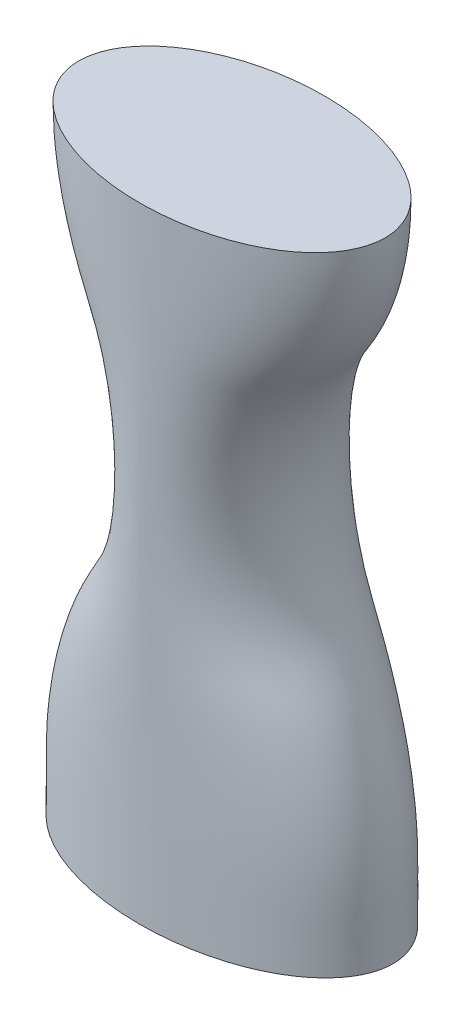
ISO-10303-21;
HEADER;
FILE_DESCRIPTION(('STEP AP214'),'2;1');
FILE_NAME('part.step','',(''),(''),'','','');
FILE_SCHEMA(('AUTOMOTIVE_DESIGN { 1 0 10303 214 1 1 1 1 }'));
ENDSEC;
DATA;
#1=APPLICATION_CONTEXT('core data for automotive mechanical design processes');
#2=APPLICATION_PROTOCOL_DEFINITION('international standard','automotive_design',2000,#1);
#3=PRODUCT_CONTEXT('',#1,'mechanical');
#4=PRODUCT('Part','Part','',(#3));
#5=PRODUCT_RELATED_PRODUCT_CATEGORY('part','',(#4));
#6=PRODUCT_DEFINITION_FORMATION('','',#4);
#7=PRODUCT_DEFINITION_CONTEXT('part definition',#1,'design');
#8=PRODUCT_DEFINITION('design','',#6,#7);
#9=PRODUCT_DEFINITION_SHAPE('','',#8);
#10=(LENGTH_UNIT() NAMED_UNIT(*) SI_UNIT(.MILLI.,.METRE.));
#11=(NAMED_UNIT(*) PLANE_ANGLE_UNIT() SI_UNIT($,.RADIAN.));
#12=(NAMED_UNIT(*) SI_UNIT($,.STERADIAN.) SOLID_ANGLE_UNIT());
#13=UNCERTAINTY_MEASURE_WITH_UNIT(LENGTH_MEASURE(1.E-05),#10,'distance_accuracy_value','');
#14=(GEOMETRIC_REPRESENTATION_CONTEXT(3) GLOBAL_UNCERTAINTY_ASSIGNED_CONTEXT((#13)) GLOBAL_UNIT_ASSIGNED_CONTEXT((#10,
#11,#12)) REPRESENTATION_CONTEXT('',''));
#15=CARTESIAN_POINT('',(0.,0.,0.));
#16=DIRECTION('',(0.,0.,1.));
#17=DIRECTION('',(1.,0.,0.));
#18=AXIS2_PLACEMENT_3D('',#15,#16,#17);
#19=CARTESIAN_POINT('',(0.,204.116240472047,0.));
#20=DIRECTION('',(0.,1.,0.));
#21=DIRECTION('',(0.,0.,1.));
#22=AXIS2_PLACEMENT_3D('',#19,#20,#21);
#23=PLANE('',#22);
#24=CARTESIAN_POINT('',(0.,204.116240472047,0.));
#25=DIRECTION('',(0.,1.,0.));
#26=DIRECTION('',(1.,0.,0.));
#27=AXIS2_PLACEMENT_3D('',#24,#25,#26);
#28=ELLIPSE('',#27,50.0616559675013,30.2413120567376);
#29=CARTESIAN_POINT('',(50.0616559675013,204.116240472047,0.));
#30=VERTEX_POINT('',#29);
#31=EDGE_CURVE('E78',#30,#30,#28,.T.);
#32=ORIENTED_EDGE('',*,*,#31,.T.);
#33=EDGE_LOOP('',(#32));
#34=FACE_BOUND('',#33,.T.);
#35=ADVANCED_FACE('F69',(#34),#23,.T.);
#36=CARTESIAN_POINT('',(0.,0.,0.));
#37=DIRECTION('',(0.,1.,0.));
#38=DIRECTION('',(0.,0.,1.));
#39=AXIS2_PLACEMENT_3D('',#36,#37,#38);
#40=PLANE('',#39);
#41=CARTESIAN_POINT('',(0.,0.,0.));
#42=DIRECTION('',(0.,1.,0.));
#43=DIRECTION('',(1.,0.,0.));
#44=AXIS2_PLACEMENT_3D('',#41,#42,#43);
#45=ELLIPSE('',#44,52.635195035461,30.2413120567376);
#46=CARTESIAN_POINT('',(52.635195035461,0.,0.));
#47=VERTEX_POINT('',#46);
#48=EDGE_CURVE('E12',#47,#47,#45,.T.);
#49=ORIENTED_EDGE('',*,*,#48,.F.);
#50=EDGE_LOOP('',(#49));
#51=FACE_BOUND('',#50,.T.);
#52=ADVANCED_FACE('F71',(#51),#40,.F.);
#53=CARTESIAN_POINT('',(52.635195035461,0.,0.));
#54=CARTESIAN_POINT('',(52.6351762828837,1.12092160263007,0.));
#55=CARTESIAN_POINT('',(52.6351387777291,3.36276480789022,0.));
#56=CARTESIAN_POINT('',(52.6354736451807,7.36629073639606,0.));
#57=CARTESIAN_POINT('',(52.632096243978,15.1719752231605,0.));
#58=CARTESIAN_POINT('',(52.6670073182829,25.7837059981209,0.));
#59=CARTESIAN_POINT('',(50.9115333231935,38.2841652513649,0.));
#60=CARTESIAN_POINT('',(48.3515622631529,48.696583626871,0.));
#61=CARTESIAN_POINT('',(44.8473468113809,58.6466024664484,0.));
#62=CARTESIAN_POINT('',(40.765714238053,67.6618741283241,0.));
#63=CARTESIAN_POINT('',(35.7358410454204,75.9266216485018,0.));
#64=CARTESIAN_POINT('',(31.6192772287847,82.8642723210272,0.));
#65=CARTESIAN_POINT('',(28.5018156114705,89.9966504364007,0.));
#66=CARTESIAN_POINT('',(26.2602337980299,96.7179673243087,0.));
#67=CARTESIAN_POINT('',(24.5466888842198,104.271865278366,0.));
#68=CARTESIAN_POINT('',(23.6446367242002,111.34131407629,0.));
#69=CARTESIAN_POINT('',(23.4113335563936,119.082905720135,0.));
#70=CARTESIAN_POINT('',(23.8922671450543,126.227275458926,0.));
#71=CARTESIAN_POINT('',(25.1493001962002,133.832482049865,0.));
#72=CARTESIAN_POINT('',(26.9925483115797,140.751452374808,0.));
#73=CARTESIAN_POINT('',(29.364653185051,147.101965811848,0.));
#74=CARTESIAN_POINT('',(31.6983259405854,152.111275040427,0.));
#75=CARTESIAN_POINT('',(33.7337723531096,155.821566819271,0.));
#76=CARTESIAN_POINT('',(35.364826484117,158.511061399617,0.));
#77=CARTESIAN_POINT('',(37.9301214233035,162.344224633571,0.));
#78=CARTESIAN_POINT('',(41.0055006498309,167.38066146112,0.));
#79=CARTESIAN_POINT('',(44.4156520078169,174.690902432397,0.));
#80=CARTESIAN_POINT('',(46.8686591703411,181.607748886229,0.));
#81=CARTESIAN_POINT('',(48.7882310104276,189.403320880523,0.));
#82=CARTESIAN_POINT('',(49.6725559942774,195.595657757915,0.));
#83=CARTESIAN_POINT('',(50.0190728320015,200.735437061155,0.));
#84=CARTESIAN_POINT('',(50.0474705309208,202.990015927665,0.));
#85=CARTESIAN_POINT('',(50.0616559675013,204.116240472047,0.));
#86=CARTESIAN_POINT('',(52.635195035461,0.,-16.6906340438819));
#87=CARTESIAN_POINT('',(52.6351762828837,1.12092160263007,-16.6906340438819));
#88=CARTESIAN_POINT('',(52.6351387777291,3.36276480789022,-16.6906340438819));
#89=CARTESIAN_POINT('',(52.6354736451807,7.36629073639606,-16.6906340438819));
#90=CARTESIAN_POINT('',(52.632096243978,15.1719752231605,-16.6906340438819));
#91=CARTESIAN_POINT('',(52.6670073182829,25.7837059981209,-16.6906340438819));
#92=CARTESIAN_POINT('',(50.9115333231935,38.2841652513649,-16.6906340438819));
#93=CARTESIAN_POINT('',(48.3515622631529,48.696583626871,-16.6906340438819));
#94=CARTESIAN_POINT('',(44.8473468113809,58.6466024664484,-16.6906340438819));
#95=CARTESIAN_POINT('',(40.765714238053,67.6618741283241,-16.6906340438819));
#96=CARTESIAN_POINT('',(35.7358410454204,75.9266216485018,-16.6906340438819));
#97=CARTESIAN_POINT('',(31.6192772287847,82.8642723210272,-16.6906340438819));
#98=CARTESIAN_POINT('',(28.5018156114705,89.9966504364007,-16.6906340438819));
#99=CARTESIAN_POINT('',(26.26023379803,96.7179673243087,-16.6906340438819));
#100=CARTESIAN_POINT('',(24.5466888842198,104.271865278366,-16.6906340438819));
#101=CARTESIAN_POINT('',(23.6446367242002,111.34131407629,-16.6906340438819));
#102=CARTESIAN_POINT('',(23.4113335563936,119.082905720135,-16.6906340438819));
#103=CARTESIAN_POINT('',(23.8922671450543,126.227275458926,-16.6906340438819));
#104=CARTESIAN_POINT('',(25.1493001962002,133.832482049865,-16.6906340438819));
#105=CARTESIAN_POINT('',(26.9925483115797,140.751452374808,-16.6906340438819));
#106=CARTESIAN_POINT('',(29.364653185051,147.101965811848,-16.6906340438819));
#107=CARTESIAN_POINT('',(31.6983259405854,152.111275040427,-16.6906340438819));
#108=CARTESIAN_POINT('',(33.7337723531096,155.821566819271,-16.6906340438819));
#109=CARTESIAN_POINT('',(35.364826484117,158.511061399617,-16.6906340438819));
#110=CARTESIAN_POINT('',(37.9301214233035,162.344224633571,-16.6906340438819));
#111=CARTESIAN_POINT('',(41.0055006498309,167.38066146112,-16.6906340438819));
#112=CARTESIAN_POINT('',(44.415652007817,174.690902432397,-16.6906340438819));
#113=CARTESIAN_POINT('',(46.8686591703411,181.607748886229,-16.6906340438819));
#114=CARTESIAN_POINT('',(48.7882310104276,189.403320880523,-16.6906340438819));
#115=CARTESIAN_POINT('',(49.6725559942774,195.595657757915,-16.6906340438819));
#116=CARTESIAN_POINT('',(50.0190728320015,200.735437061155,-16.6906340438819));
#117=CARTESIAN_POINT('',(50.0474705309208,202.990015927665,-16.6906340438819));
#118=CARTESIAN_POINT('',(50.0616559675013,204.116240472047,-16.6906340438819));
#119=CARTESIAN_POINT('',(29.0501541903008,0.,-30.2413120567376));
#120=CARTESIAN_POINT('',(29.0501438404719,1.12092160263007,-30.2413120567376));
#121=CARTESIAN_POINT('',(29.0501231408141,3.36276480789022,-30.2413120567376));
#122=CARTESIAN_POINT('',(29.050307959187,7.36629073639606,-30.2413120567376));
#123=CARTESIAN_POINT('',(29.0484439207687,15.1719752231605,-30.2413120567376));
#124=CARTESIAN_POINT('',(29.0677118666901,25.7837059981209,-30.2413120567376));
#125=CARTESIAN_POINT('',(28.0988394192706,38.2841652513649,-30.2413120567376));
#126=CARTESIAN_POINT('',(26.6859529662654,48.696583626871,-30.2413120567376));
#127=CARTESIAN_POINT('',(24.751923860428,58.6466024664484,-30.2413120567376));
#128=CARTESIAN_POINT('',(22.4992095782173,67.6618741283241,-30.2413120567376));
#129=CARTESIAN_POINT('',(19.7231470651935,75.9266216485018,-30.2413120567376));
#130=CARTESIAN_POINT('',(17.451153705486,82.8642723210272,-30.2413120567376));
#131=CARTESIAN_POINT('',(15.7305798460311,89.9966504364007,-30.2413120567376));
#132=CARTESIAN_POINT('',(14.4934171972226,96.7179673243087,-30.2413120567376));
#133=CARTESIAN_POINT('',(13.5476860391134,104.271865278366,-30.2413120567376));
#134=CARTESIAN_POINT('',(13.049829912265,111.34131407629,-30.2413120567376));
#135=CARTESIAN_POINT('',(12.92106639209,119.082905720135,-30.2413120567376));
#136=CARTESIAN_POINT('',(13.186500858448,126.227275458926,-30.2413120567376));
#137=CARTESIAN_POINT('',(13.8802762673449,133.832482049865,-30.2413120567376));
#138=CARTESIAN_POINT('',(14.8975925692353,140.751452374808,-30.2413120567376));
#139=CARTESIAN_POINT('',(16.2067928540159,147.101965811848,-30.2413120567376));
#140=CARTESIAN_POINT('',(17.4947818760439,152.111275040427,-30.2413120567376));
#141=CARTESIAN_POINT('',(18.6181753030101,155.821566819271,-30.2413120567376));
#142=CARTESIAN_POINT('',(19.5183785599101,158.511061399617,-30.2413120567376));
#143=CARTESIAN_POINT('',(20.9342033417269,162.344224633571,-30.2413120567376));
#144=CARTESIAN_POINT('',(22.6315512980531,167.38066146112,-30.2413120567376));
#145=CARTESIAN_POINT('',(24.5136650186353,174.690902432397,-30.2413120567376));
#146=CARTESIAN_POINT('',(25.8675164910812,181.607748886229,-30.2413120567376));
#147=CARTESIAN_POINT('',(26.9269570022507,189.403320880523,-30.2413120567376));
#148=CARTESIAN_POINT('',(27.4150292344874,195.595657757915,-30.2413120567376));
#149=CARTESIAN_POINT('',(27.6062770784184,200.735437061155,-30.2413120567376));
#150=CARTESIAN_POINT('',(27.6219501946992,202.990015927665,-30.2413120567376));
#151=CARTESIAN_POINT('',(27.6297793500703,204.116240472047,-30.2413120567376));
#152=CARTESIAN_POINT('',(-29.0501541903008,0.,-30.2413120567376));
#153=CARTESIAN_POINT('',(-29.0501438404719,1.12092160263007,-30.2413120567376));
#154=CARTESIAN_POINT('',(-29.0501231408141,3.36276480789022,-30.2413120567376));
#155=CARTESIAN_POINT('',(-29.050307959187,7.36629073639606,-30.2413120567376));
#156=CARTESIAN_POINT('',(-29.0484439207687,15.1719752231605,-30.2413120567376));
#157=CARTESIAN_POINT('',(-29.0677118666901,25.7837059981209,-30.2413120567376));
#158=CARTESIAN_POINT('',(-28.0988394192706,38.2841652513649,-30.2413120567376));
#159=CARTESIAN_POINT('',(-26.6859529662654,48.696583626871,-30.2413120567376));
#160=CARTESIAN_POINT('',(-24.751923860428,58.6466024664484,-30.2413120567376));
#161=CARTESIAN_POINT('',(-22.4992095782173,67.6618741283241,-30.2413120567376));
#162=CARTESIAN_POINT('',(-19.7231470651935,75.9266216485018,-30.2413120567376));
#163=CARTESIAN_POINT('',(-17.451153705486,82.8642723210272,-30.2413120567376));
#164=CARTESIAN_POINT('',(-15.7305798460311,89.9966504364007,-30.2413120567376));
#165=CARTESIAN_POINT('',(-14.4934171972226,96.7179673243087,-30.2413120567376));
#166=CARTESIAN_POINT('',(-13.5476860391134,104.271865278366,-30.2413120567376));
#167=CARTESIAN_POINT('',(-13.049829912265,111.34131407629,-30.2413120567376));
#168=CARTESIAN_POINT('',(-12.92106639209,119.082905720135,-30.2413120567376));
#169=CARTESIAN_POINT('',(-13.186500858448,126.227275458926,-30.2413120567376));
#170=CARTESIAN_POINT('',(-13.8802762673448,133.832482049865,-30.2413120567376));
#171=CARTESIAN_POINT('',(-14.8975925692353,140.751452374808,-30.2413120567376));
#172=CARTESIAN_POINT('',(-16.2067928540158,147.101965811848,-30.2413120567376));
#173=CARTESIAN_POINT('',(-17.4947818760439,152.111275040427,-30.2413120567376));
#174=CARTESIAN_POINT('',(-18.6181753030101,155.821566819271,-30.2413120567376));
#175=CARTESIAN_POINT('',(-19.5183785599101,158.511061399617,-30.2413120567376));
#176=CARTESIAN_POINT('',(-20.9342033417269,162.344224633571,-30.2413120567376));
#177=CARTESIAN_POINT('',(-22.6315512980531,167.38066146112,-30.2413120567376));
#178=CARTESIAN_POINT('',(-24.5136650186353,174.690902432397,-30.2413120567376));
#179=CARTESIAN_POINT('',(-25.8675164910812,181.607748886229,-30.2413120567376));
#180=CARTESIAN_POINT('',(-26.9269570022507,189.403320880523,-30.2413120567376));
#181=CARTESIAN_POINT('',(-27.4150292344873,195.595657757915,-30.2413120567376));
#182=CARTESIAN_POINT('',(-27.6062770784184,200.735437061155,-30.2413120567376));
#183=CARTESIAN_POINT('',(-27.6219501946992,202.990015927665,-30.2413120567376));
#184=CARTESIAN_POINT('',(-27.6297793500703,204.116240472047,-30.2413120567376));
#185=CARTESIAN_POINT('',(-52.635195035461,0.,-16.6906340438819));
#186=CARTESIAN_POINT('',(-52.6351762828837,1.12092160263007,-16.6906340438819));
#187=CARTESIAN_POINT('',(-52.6351387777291,3.36276480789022,-16.6906340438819));
#188=CARTESIAN_POINT('',(-52.6354736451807,7.36629073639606,-16.6906340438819));
#189=CARTESIAN_POINT('',(-52.632096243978,15.1719752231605,-16.6906340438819));
#190=CARTESIAN_POINT('',(-52.6670073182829,25.7837059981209,-16.6906340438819));
#191=CARTESIAN_POINT('',(-50.9115333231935,38.2841652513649,-16.6906340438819));
#192=CARTESIAN_POINT('',(-48.3515622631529,48.696583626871,-16.6906340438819));
#193=CARTESIAN_POINT('',(-44.8473468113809,58.6466024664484,-16.6906340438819));
#194=CARTESIAN_POINT('',(-40.765714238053,67.6618741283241,-16.6906340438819));
#195=CARTESIAN_POINT('',(-35.7358410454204,75.9266216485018,-16.6906340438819));
#196=CARTESIAN_POINT('',(-31.6192772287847,82.8642723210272,-16.6906340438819));
#197=CARTESIAN_POINT('',(-28.5018156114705,89.9966504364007,-16.6906340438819));
#198=CARTESIAN_POINT('',(-26.2602337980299,96.7179673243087,-16.6906340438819));
#199=CARTESIAN_POINT('',(-24.5466888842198,104.271865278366,-16.6906340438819));
#200=CARTESIAN_POINT('',(-23.6446367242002,111.34131407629,-16.6906340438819));
#201=CARTESIAN_POINT('',(-23.4113335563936,119.082905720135,-16.6906340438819));
#202=CARTESIAN_POINT('',(-23.8922671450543,126.227275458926,-16.6906340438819));
#203=CARTESIAN_POINT('',(-25.1493001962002,133.832482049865,-16.6906340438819));
#204=CARTESIAN_POINT('',(-26.9925483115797,140.751452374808,-16.6906340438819));
#205=CARTESIAN_POINT('',(-29.364653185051,147.101965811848,-16.6906340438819));
#206=CARTESIAN_POINT('',(-31.6983259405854,152.111275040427,-16.6906340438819));
#207=CARTESIAN_POINT('',(-33.7337723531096,155.821566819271,-16.6906340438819));
#208=CARTESIAN_POINT('',(-35.3648264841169,158.511061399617,-16.6906340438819));
#209=CARTESIAN_POINT('',(-37.9301214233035,162.344224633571,-16.6906340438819));
#210=CARTESIAN_POINT('',(-41.0055006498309,167.38066146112,-16.6906340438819));
#211=CARTESIAN_POINT('',(-44.4156520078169,174.690902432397,-16.6906340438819));
#212=CARTESIAN_POINT('',(-46.8686591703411,181.607748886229,-16.6906340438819));
#213=CARTESIAN_POINT('',(-48.7882310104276,189.403320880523,-16.6906340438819));
#214=CARTESIAN_POINT('',(-49.6725559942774,195.595657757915,-16.6906340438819));
#215=CARTESIAN_POINT('',(-50.0190728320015,200.735437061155,-16.6906340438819));
#216=CARTESIAN_POINT('',(-50.0474705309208,202.990015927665,-16.6906340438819));
#217=CARTESIAN_POINT('',(-50.0616559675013,204.116240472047,-16.6906340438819));
#218=CARTESIAN_POINT('',(-52.635195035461,0.,16.6906340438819));
#219=CARTESIAN_POINT('',(-52.6351762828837,1.12092160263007,16.6906340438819));
#220=CARTESIAN_POINT('',(-52.6351387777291,3.36276480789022,16.6906340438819));
#221=CARTESIAN_POINT('',(-52.6354736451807,7.36629073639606,16.6906340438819));
#222=CARTESIAN_POINT('',(-52.632096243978,15.1719752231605,16.6906340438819));
#223=CARTESIAN_POINT('',(-52.6670073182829,25.7837059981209,16.6906340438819));
#224=CARTESIAN_POINT('',(-50.9115333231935,38.2841652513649,16.6906340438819));
#225=CARTESIAN_POINT('',(-48.3515622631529,48.696583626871,16.6906340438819));
#226=CARTESIAN_POINT('',(-44.8473468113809,58.6466024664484,16.6906340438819));
#227=CARTESIAN_POINT('',(-40.765714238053,67.6618741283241,16.6906340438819));
#228=CARTESIAN_POINT('',(-35.7358410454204,75.9266216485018,16.6906340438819));
#229=CARTESIAN_POINT('',(-31.6192772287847,82.8642723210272,16.6906340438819));
#230=CARTESIAN_POINT('',(-28.5018156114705,89.9966504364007,16.6906340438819));
#231=CARTESIAN_POINT('',(-26.26023379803,96.7179673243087,16.6906340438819));
#232=CARTESIAN_POINT('',(-24.5466888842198,104.271865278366,16.6906340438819));
#233=CARTESIAN_POINT('',(-23.6446367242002,111.34131407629,16.6906340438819));
#234=CARTESIAN_POINT('',(-23.4113335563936,119.082905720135,16.6906340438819));
#235=CARTESIAN_POINT('',(-23.8922671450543,126.227275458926,16.6906340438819));
#236=CARTESIAN_POINT('',(-25.1493001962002,133.832482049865,16.6906340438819));
#237=CARTESIAN_POINT('',(-26.9925483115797,140.751452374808,16.6906340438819));
#238=CARTESIAN_POINT('',(-29.364653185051,147.101965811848,16.6906340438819));
#239=CARTESIAN_POINT('',(-31.6983259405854,152.111275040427,16.6906340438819));
#240=CARTESIAN_POINT('',(-33.7337723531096,155.821566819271,16.6906340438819));
#241=CARTESIAN_POINT('',(-35.364826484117,158.511061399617,16.6906340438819));
#242=CARTESIAN_POINT('',(-37.9301214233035,162.344224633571,16.6906340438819));
#243=CARTESIAN_POINT('',(-41.0055006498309,167.38066146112,16.6906340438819));
#244=CARTESIAN_POINT('',(-44.4156520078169,174.690902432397,16.6906340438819));
#245=CARTESIAN_POINT('',(-46.8686591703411,181.607748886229,16.6906340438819));
#246=CARTESIAN_POINT('',(-48.7882310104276,189.403320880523,16.6906340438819));
#247=CARTESIAN_POINT('',(-49.6725559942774,195.595657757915,16.6906340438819));
#248=CARTESIAN_POINT('',(-50.0190728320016,200.735437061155,16.6906340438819));
#249=CARTESIAN_POINT('',(-50.0474705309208,202.990015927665,16.6906340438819));
#250=CARTESIAN_POINT('',(-50.0616559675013,204.116240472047,16.6906340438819));
#251=CARTESIAN_POINT('',(-29.0501541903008,0.,30.2413120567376));
#252=CARTESIAN_POINT('',(-29.0501438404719,1.12092160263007,30.2413120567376));
#253=CARTESIAN_POINT('',(-29.0501231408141,3.36276480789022,30.2413120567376));
#254=CARTESIAN_POINT('',(-29.050307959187,7.36629073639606,30.2413120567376));
#255=CARTESIAN_POINT('',(-29.0484439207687,15.1719752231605,30.2413120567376));
#256=CARTESIAN_POINT('',(-29.0677118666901,25.7837059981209,30.2413120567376));
#257=CARTESIAN_POINT('',(-28.0988394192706,38.2841652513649,30.2413120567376));
#258=CARTESIAN_POINT('',(-26.6859529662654,48.696583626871,30.2413120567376));
#259=CARTESIAN_POINT('',(-24.751923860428,58.6466024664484,30.2413120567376));
#260=CARTESIAN_POINT('',(-22.4992095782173,67.6618741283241,30.2413120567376));
#261=CARTESIAN_POINT('',(-19.7231470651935,75.9266216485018,30.2413120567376));
#262=CARTESIAN_POINT('',(-17.451153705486,82.8642723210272,30.2413120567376));
#263=CARTESIAN_POINT('',(-15.7305798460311,89.9966504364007,30.2413120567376));
#264=CARTESIAN_POINT('',(-14.4934171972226,96.7179673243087,30.2413120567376));
#265=CARTESIAN_POINT('',(-13.5476860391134,104.271865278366,30.2413120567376));
#266=CARTESIAN_POINT('',(-13.049829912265,111.34131407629,30.2413120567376));
#267=CARTESIAN_POINT('',(-12.92106639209,119.082905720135,30.2413120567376));
#268=CARTESIAN_POINT('',(-13.186500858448,126.227275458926,30.2413120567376));
#269=CARTESIAN_POINT('',(-13.8802762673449,133.832482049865,30.2413120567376));
#270=CARTESIAN_POINT('',(-14.8975925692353,140.751452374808,30.2413120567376));
#271=CARTESIAN_POINT('',(-16.2067928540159,147.101965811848,30.2413120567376));
#272=CARTESIAN_POINT('',(-17.4947818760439,152.111275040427,30.2413120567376));
#273=CARTESIAN_POINT('',(-18.6181753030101,155.821566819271,30.2413120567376));
#274=CARTESIAN_POINT('',(-19.5183785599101,158.511061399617,30.2413120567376));
#275=CARTESIAN_POINT('',(-20.9342033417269,162.344224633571,30.2413120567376));
#276=CARTESIAN_POINT('',(-22.6315512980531,167.38066146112,30.2413120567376));
#277=CARTESIAN_POINT('',(-24.5136650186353,174.690902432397,30.2413120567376));
#278=CARTESIAN_POINT('',(-25.8675164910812,181.607748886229,30.2413120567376));
#279=CARTESIAN_POINT('',(-26.9269570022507,189.403320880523,30.2413120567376));
#280=CARTESIAN_POINT('',(-27.4150292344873,195.595657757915,30.2413120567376));
#281=CARTESIAN_POINT('',(-27.6062770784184,200.735437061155,30.2413120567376));
#282=CARTESIAN_POINT('',(-27.6219501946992,202.990015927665,30.2413120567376));
#283=CARTESIAN_POINT('',(-27.6297793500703,204.116240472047,30.2413120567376));
#284=CARTESIAN_POINT('',(29.0501541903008,0.,30.2413120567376));
#285=CARTESIAN_POINT('',(29.0501438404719,1.12092160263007,30.2413120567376));
#286=CARTESIAN_POINT('',(29.0501231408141,3.36276480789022,30.2413120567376));
#287=CARTESIAN_POINT('',(29.050307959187,7.36629073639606,30.2413120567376));
#288=CARTESIAN_POINT('',(29.0484439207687,15.1719752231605,30.2413120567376));
#289=CARTESIAN_POINT('',(29.0677118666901,25.7837059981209,30.2413120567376));
#290=CARTESIAN_POINT('',(28.0988394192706,38.2841652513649,30.2413120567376));
#291=CARTESIAN_POINT('',(26.6859529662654,48.696583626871,30.2413120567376));
#292=CARTESIAN_POINT('',(24.751923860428,58.6466024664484,30.2413120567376));
#293=CARTESIAN_POINT('',(22.4992095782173,67.6618741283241,30.2413120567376));
#294=CARTESIAN_POINT('',(19.7231470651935,75.9266216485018,30.2413120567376));
#295=CARTESIAN_POINT('',(17.451153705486,82.8642723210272,30.2413120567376));
#296=CARTESIAN_POINT('',(15.7305798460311,89.9966504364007,30.2413120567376));
#297=CARTESIAN_POINT('',(14.4934171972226,96.7179673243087,30.2413120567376));
#298=CARTESIAN_POINT('',(13.5476860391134,104.271865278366,30.2413120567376));
#299=CARTESIAN_POINT('',(13.049829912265,111.34131407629,30.2413120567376));
#300=CARTESIAN_POINT('',(12.9210663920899,119.082905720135,30.2413120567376));
#301=CARTESIAN_POINT('',(13.186500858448,126.227275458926,30.2413120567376));
#302=CARTESIAN_POINT('',(13.8802762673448,133.832482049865,30.2413120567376));
#303=CARTESIAN_POINT('',(14.8975925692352,140.751452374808,30.2413120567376));
#304=CARTESIAN_POINT('',(16.2067928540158,147.101965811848,30.2413120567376));
#305=CARTESIAN_POINT('',(17.4947818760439,152.111275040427,30.2413120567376));
#306=CARTESIAN_POINT('',(18.6181753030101,155.821566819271,30.2413120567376));
#307=CARTESIAN_POINT('',(19.5183785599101,158.511061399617,30.2413120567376));
#308=CARTESIAN_POINT('',(20.9342033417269,162.344224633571,30.2413120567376));
#309=CARTESIAN_POINT('',(22.6315512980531,167.38066146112,30.2413120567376));
#310=CARTESIAN_POINT('',(24.5136650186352,174.690902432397,30.2413120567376));
#311=CARTESIAN_POINT('',(25.8675164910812,181.607748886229,30.2413120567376));
#312=CARTESIAN_POINT('',(26.9269570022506,189.403320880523,30.2413120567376));
#313=CARTESIAN_POINT('',(27.4150292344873,195.595657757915,30.2413120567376));
#314=CARTESIAN_POINT('',(27.6062770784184,200.735437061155,30.2413120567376));
#315=CARTESIAN_POINT('',(27.6219501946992,202.990015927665,30.2413120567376));
#316=CARTESIAN_POINT('',(27.6297793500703,204.116240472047,30.2413120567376));
#317=CARTESIAN_POINT('',(52.635195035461,0.,16.6906340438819));
#318=CARTESIAN_POINT('',(52.6351762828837,1.12092160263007,16.6906340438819));
#319=CARTESIAN_POINT('',(52.6351387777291,3.36276480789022,16.6906340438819));
#320=CARTESIAN_POINT('',(52.6354736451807,7.36629073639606,16.6906340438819));
#321=CARTESIAN_POINT('',(52.632096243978,15.1719752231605,16.6906340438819));
#322=CARTESIAN_POINT('',(52.6670073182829,25.7837059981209,16.6906340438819));
#323=CARTESIAN_POINT('',(50.9115333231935,38.2841652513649,16.6906340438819));
#324=CARTESIAN_POINT('',(48.3515622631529,48.696583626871,16.6906340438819));
#325=CARTESIAN_POINT('',(44.8473468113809,58.6466024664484,16.6906340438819));
#326=CARTESIAN_POINT('',(40.765714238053,67.6618741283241,16.6906340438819));
#327=CARTESIAN_POINT('',(35.7358410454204,75.9266216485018,16.6906340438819));
#328=CARTESIAN_POINT('',(31.6192772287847,82.8642723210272,16.6906340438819));
#329=CARTESIAN_POINT('',(28.5018156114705,89.9966504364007,16.6906340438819));
#330=CARTESIAN_POINT('',(26.2602337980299,96.7179673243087,16.6906340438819));
#331=CARTESIAN_POINT('',(24.5466888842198,104.271865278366,16.6906340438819));
#332=CARTESIAN_POINT('',(23.6446367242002,111.34131407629,16.6906340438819));
#333=CARTESIAN_POINT('',(23.4113335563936,119.082905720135,16.6906340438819));
#334=CARTESIAN_POINT('',(23.8922671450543,126.227275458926,16.6906340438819));
#335=CARTESIAN_POINT('',(25.1493001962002,133.832482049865,16.6906340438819));
#336=CARTESIAN_POINT('',(26.9925483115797,140.751452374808,16.6906340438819));
#337=CARTESIAN_POINT('',(29.364653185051,147.101965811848,16.6906340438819));
#338=CARTESIAN_POINT('',(31.6983259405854,152.111275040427,16.6906340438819));
#339=CARTESIAN_POINT('',(33.7337723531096,155.821566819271,16.6906340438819));
#340=CARTESIAN_POINT('',(35.3648264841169,158.511061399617,16.6906340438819));
#341=CARTESIAN_POINT('',(37.9301214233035,162.344224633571,16.6906340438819));
#342=CARTESIAN_POINT('',(41.0055006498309,167.38066146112,16.6906340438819));
#343=CARTESIAN_POINT('',(44.4156520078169,174.690902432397,16.6906340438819));
#344=CARTESIAN_POINT('',(46.8686591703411,181.607748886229,16.6906340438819));
#345=CARTESIAN_POINT('',(48.7882310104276,189.403320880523,16.6906340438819));
#346=CARTESIAN_POINT('',(49.6725559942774,195.595657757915,16.6906340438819));
#347=CARTESIAN_POINT('',(50.0190728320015,200.735437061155,16.6906340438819));
#348=CARTESIAN_POINT('',(50.0474705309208,202.990015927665,16.6906340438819));
#349=CARTESIAN_POINT('',(50.0616559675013,204.116240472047,16.6906340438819));
#350=CARTESIAN_POINT('',(52.635195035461,0.,0.));
#351=CARTESIAN_POINT('',(52.6351762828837,1.12092160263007,0.));
#352=CARTESIAN_POINT('',(52.6351387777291,3.36276480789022,0.));
#353=CARTESIAN_POINT('',(52.6354736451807,7.36629073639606,0.));
#354=CARTESIAN_POINT('',(52.632096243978,15.1719752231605,0.));
#355=CARTESIAN_POINT('',(52.6670073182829,25.7837059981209,0.));
#356=CARTESIAN_POINT('',(50.9115333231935,38.2841652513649,0.));
#357=CARTESIAN_POINT('',(48.3515622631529,48.696583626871,0.));
#358=CARTESIAN_POINT('',(44.8473468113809,58.6466024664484,0.));
#359=CARTESIAN_POINT('',(40.765714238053,67.6618741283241,0.));
#360=CARTESIAN_POINT('',(35.7358410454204,75.9266216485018,0.));
#361=CARTESIAN_POINT('',(31.6192772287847,82.8642723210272,0.));
#362=CARTESIAN_POINT('',(28.5018156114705,89.9966504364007,0.));
#363=CARTESIAN_POINT('',(26.2602337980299,96.7179673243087,0.));
#364=CARTESIAN_POINT('',(24.5466888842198,104.271865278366,0.));
#365=CARTESIAN_POINT('',(23.6446367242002,111.34131407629,0.));
#366=CARTESIAN_POINT('',(23.4113335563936,119.082905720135,0.));
#367=CARTESIAN_POINT('',(23.8922671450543,126.227275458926,0.));
#368=CARTESIAN_POINT('',(25.1493001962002,133.832482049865,0.));
#369=CARTESIAN_POINT('',(26.9925483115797,140.751452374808,0.));
#370=CARTESIAN_POINT('',(29.364653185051,147.101965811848,0.));
#371=CARTESIAN_POINT('',(31.6983259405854,152.111275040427,0.));
#372=CARTESIAN_POINT('',(33.7337723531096,155.821566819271,0.));
#373=CARTESIAN_POINT('',(35.364826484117,158.511061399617,0.));
#374=CARTESIAN_POINT('',(37.9301214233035,162.344224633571,0.));
#375=CARTESIAN_POINT('',(41.0055006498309,167.38066146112,0.));
#376=CARTESIAN_POINT('',(44.4156520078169,174.690902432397,0.));
#377=CARTESIAN_POINT('',(46.8686591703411,181.607748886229,0.));
#378=CARTESIAN_POINT('',(48.7882310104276,189.403320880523,0.));
#379=CARTESIAN_POINT('',(49.6725559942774,195.595657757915,0.));
#380=CARTESIAN_POINT('',(50.0190728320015,200.735437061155,0.));
#381=CARTESIAN_POINT('',(50.0474705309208,202.990015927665,0.));
#382=CARTESIAN_POINT('',(50.0616559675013,204.116240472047,0.));
#383=B_SPLINE_SURFACE_WITH_KNOTS('',3,3,((#53,#54,#55,#56,#57,#58,#59,#60,#61,#62,#63,#64,#65,
#66,#67,#68,#69,#70,#71,#72,#73,#74,#75,#76,#77,#78,#79,#80,#81,#82,#83,#84,#85),(#86,#87,#88,
#89,#90,#91,#92,#93,#94,#95,#96,#97,#98,#99,#100,#101,#102,#103,#104,#105,#106,#107,#108,#109,
#110,#111,#112,#113,#114,#115,#116,#117,#118),(#119,#120,#121,#122,#123,#124,#125,#126,#127,
#128,#129,#130,#131,#132,#133,#134,#135,#136,#137,#138,#139,#140,#141,#142,#143,#144,#145,#146,
#147,#148,#149,#150,#151),(#152,#153,#154,#155,#156,#157,#158,#159,#160,#161,#162,#163,#164,
#165,#166,#167,#168,#169,#170,#171,#172,#173,#174,#175,#176,#177,#178,#179,#180,#181,#182,#183,
#184),(#185,#186,#187,#188,#189,#190,#191,#192,#193,#194,#195,#196,#197,#198,#199,#200,#201,
#202,#203,#204,#205,#206,#207,#208,#209,#210,#211,#212,#213,#214,#215,#216,#217),(#218,#219,
#220,#221,#222,#223,#224,#225,#226,#227,#228,#229,#230,#231,#232,#233,#234,#235,#236,#237,#238,
#239,#240,#241,#242,#243,#244,#245,#246,#247,#248,#249,#250),(#251,#252,#253,#254,#255,#256,
#257,#258,#259,#260,#261,#262,#263,#264,#265,#266,#267,#268,#269,#270,#271,#272,#273,#274,#275,
#276,#277,#278,#279,#280,#281,#282,#283),(#284,#285,#286,#287,#288,#289,#290,#291,#292,#293,
#294,#295,#296,#297,#298,#299,#300,#301,#302,#303,#304,#305,#306,#307,#308,#309,#310,#311,#312,
#313,#314,#315,#316),(#317,#318,#319,#320,#321,#322,#323,#324,#325,#326,#327,#328,#329,#330,
#331,#332,#333,#334,#335,#336,#337,#338,#339,#340,#341,#342,#343,#344,#345,#346,#347,#348,#349),
(#350,#351,#352,#353,#354,#355,#356,#357,#358,#359,#360,#361,#362,#363,#364,#365,#366,#367,#368,
#369,#370,#371,#372,#373,#374,#375,#376,#377,#378,#379,#380,#381,#382)),.UNSPECIFIED.,.T.,.F.,
.F.,(4,2,2,2,4),(4,1,1,1,1,1,1,1,1,1,1,1,1,1,1,1,1,1,1,1,1,1,1,1,1,1,1,1,1,1,4),(0.,0.25,0.5,
0.75,1.),(0.,0.0156444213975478,0.0312888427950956,0.0558729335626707,0.124612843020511,
0.179108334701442,0.231587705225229,0.27400197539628,0.326214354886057,0.369315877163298,
0.408978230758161,0.438657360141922,0.477769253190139,0.507680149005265,0.546641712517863,
0.577021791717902,0.61566089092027,0.646363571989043,0.684489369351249,0.715386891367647,
0.740864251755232,0.761547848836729,0.774422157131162,0.784747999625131,0.825923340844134,
0.856611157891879,0.897181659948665,0.928128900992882,0.968536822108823,0.984283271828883,1.),.UNSPECIFIED.);
#384=ORIENTED_EDGE('',*,*,#48,.T.);
#385=EDGE_LOOP('',(#384));
#386=FACE_BOUND('',#385,.T.);
#387=ORIENTED_EDGE('',*,*,#31,.F.);
#388=EDGE_LOOP('',(#387));
#389=FACE_BOUND('',#388,.T.);
#390=ADVANCED_FACE('F104',(#386,#389),#383,.T.);
#391=CLOSED_SHELL('',(#35,#52,#390));
#392=MANIFOLD_SOLID_BREP('B2',#391);
#393=ADVANCED_BREP_SHAPE_REPRESENTATION('',(#18,#392),#14);
#394=SHAPE_DEFINITION_REPRESENTATION(#9,#393);
ENDSEC;
END-ISO-10303-21;
